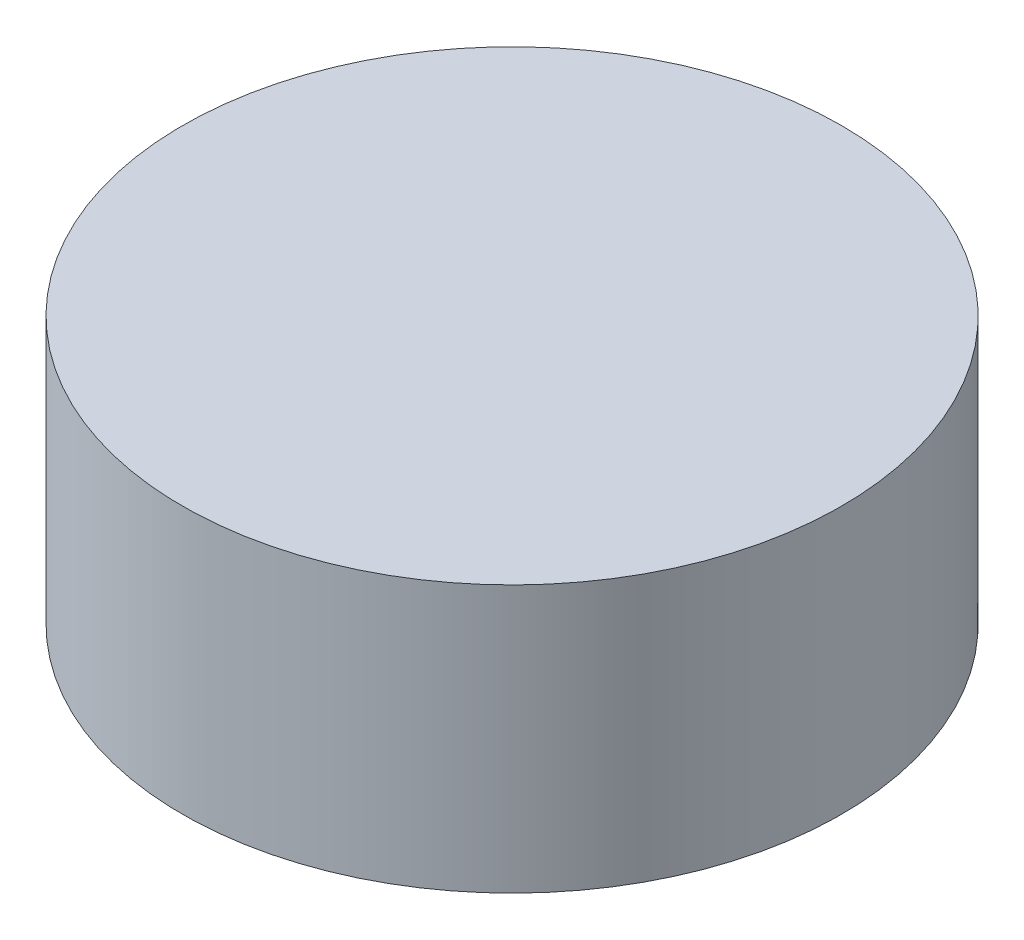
from build123d import *


with BuildPart() as part:
    # Skizze1 → Rotation1 (revolve)
    with BuildSketch(Plane.XY, mode=Mode.PRIVATE) as rotation1_sk:
        with BuildLine():
            Line((7, 0.142186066), (7, 5.811547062))
            Line((7, 5.811547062), (0, 5.811547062))
            Line((0, 5.811547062), (0, -1.188452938))
            ThreePointArc((0, -1.188452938), (0.545080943, -1.128306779), (1.063934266, -0.95076235))
            ThreePointArc((1.063934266, -0.95076235), (3.139347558, -0.240584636), (5.31967133, 0))
            ThreePointArc((5.31967133, 0), (6.162838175, 0.03560992), (7, 0.142186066))
        make_face()
    revolve(rotation1_sk.sketch.rotate(Axis((0, 0, 0), (0, 1, 0)), 90), axis=Axis((0, 0, 0), (0, 1, 0)))


solid = part.part
